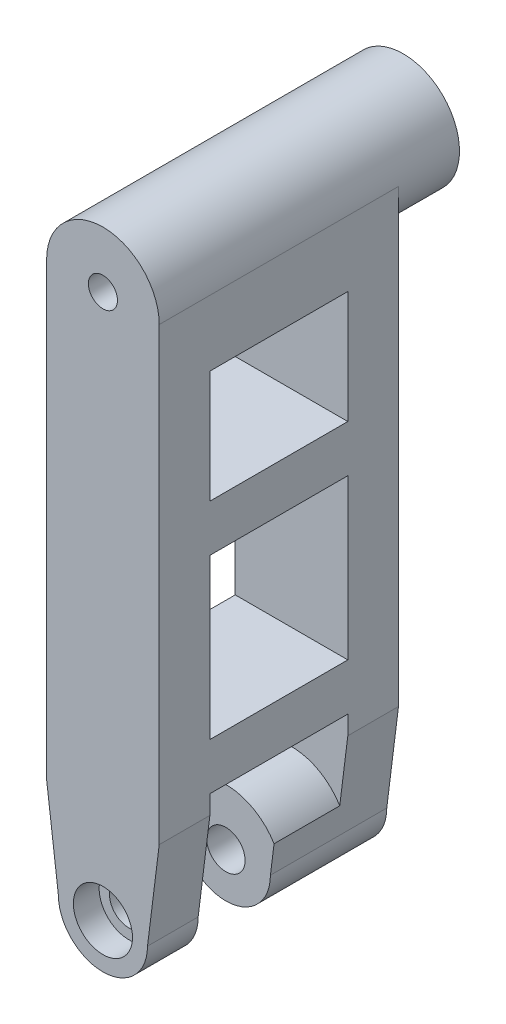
ISO-10303-21;
HEADER;
FILE_DESCRIPTION(('STEP AP214'),'2;1');
FILE_NAME('part.step','',(''),(''),'','','');
FILE_SCHEMA(('AUTOMOTIVE_DESIGN { 1 0 10303 214 1 1 1 1 }'));
ENDSEC;
DATA;
#1=APPLICATION_CONTEXT('core data for automotive mechanical design processes');
#2=APPLICATION_PROTOCOL_DEFINITION('international standard','automotive_design',2000,#1);
#3=PRODUCT_CONTEXT('',#1,'mechanical');
#4=PRODUCT('Part','Part','',(#3));
#5=PRODUCT_RELATED_PRODUCT_CATEGORY('part','',(#4));
#6=PRODUCT_DEFINITION_FORMATION('','',#4);
#7=PRODUCT_DEFINITION_CONTEXT('part definition',#1,'design');
#8=PRODUCT_DEFINITION('design','',#6,#7);
#9=PRODUCT_DEFINITION_SHAPE('','',#8);
#10=(LENGTH_UNIT() NAMED_UNIT(*) SI_UNIT(.MILLI.,.METRE.));
#11=(NAMED_UNIT(*) PLANE_ANGLE_UNIT() SI_UNIT($,.RADIAN.));
#12=(NAMED_UNIT(*) SI_UNIT($,.STERADIAN.) SOLID_ANGLE_UNIT());
#13=UNCERTAINTY_MEASURE_WITH_UNIT(LENGTH_MEASURE(1.E-05),#10,'distance_accuracy_value','');
#14=(GEOMETRIC_REPRESENTATION_CONTEXT(3) GLOBAL_UNCERTAINTY_ASSIGNED_CONTEXT((#13)) GLOBAL_UNIT_ASSIGNED_CONTEXT((#10,
#11,#12)) REPRESENTATION_CONTEXT('',''));
#15=CARTESIAN_POINT('',(0.,0.,0.));
#16=DIRECTION('',(0.,0.,1.));
#17=DIRECTION('',(1.,0.,0.));
#18=AXIS2_PLACEMENT_3D('',#15,#16,#17);
#19=CARTESIAN_POINT('',(6.,0.,-25.5));
#20=DIRECTION('',(0.,0.,1.));
#21=DIRECTION('',(1.,0.,0.));
#22=AXIS2_PLACEMENT_3D('',#19,#20,#21);
#23=CYLINDRICAL_SURFACE('',#22,2.05);
#24=CARTESIAN_POINT('',(6.,0.,-5.4));
#25=DIRECTION('',(0.,0.,1.));
#26=DIRECTION('',(1.,0.,0.));
#27=AXIS2_PLACEMENT_3D('',#24,#25,#26);
#28=CIRCLE('',#27,2.05);
#29=CARTESIAN_POINT('',(8.05,0.,-5.4));
#30=VERTEX_POINT('',#29);
#31=EDGE_CURVE('E413',#30,#30,#28,.F.);
#32=ORIENTED_EDGE('',*,*,#31,.T.);
#33=EDGE_LOOP('',(#32));
#34=FACE_BOUND('',#33,.T.);
#35=CARTESIAN_POINT('',(6.,0.,-2.75));
#36=DIRECTION('',(0.,0.,1.));
#37=DIRECTION('',(1.,0.,0.));
#38=AXIS2_PLACEMENT_3D('',#35,#36,#37);
#39=CIRCLE('',#38,2.05);
#40=CARTESIAN_POINT('',(8.05,0.,-2.75));
#41=VERTEX_POINT('',#40);
#42=EDGE_CURVE('E47',#41,#41,#39,.F.);
#43=ORIENTED_EDGE('',*,*,#42,.F.);
#44=EDGE_LOOP('',(#43));
#45=FACE_BOUND('',#44,.T.);
#46=ADVANCED_FACE('F43',(#34,#45),#23,.F.);
#47=CARTESIAN_POINT('',(6.,0.,-13.1));
#48=DIRECTION('',(0.,0.,1.));
#49=DIRECTION('',(1.,0.,0.));
#50=AXIS2_PLACEMENT_3D('',#47,#48,#49);
#51=CIRCLE('',#50,2.05);
#52=CARTESIAN_POINT('',(8.05,0.,-13.1));
#53=VERTEX_POINT('',#52);
#54=EDGE_CURVE('E335',#53,#53,#51,.F.);
#55=ORIENTED_EDGE('',*,*,#54,.F.);
#56=EDGE_LOOP('',(#55));
#57=FACE_BOUND('',#56,.T.);
#58=CARTESIAN_POINT('',(6.,0.,-22.75));
#59=DIRECTION('',(0.,0.,-1.));
#60=DIRECTION('',(-1.,0.,0.));
#61=AXIS2_PLACEMENT_3D('',#58,#59,#60);
#62=CIRCLE('',#61,2.05);
#63=CARTESIAN_POINT('',(3.95,0.,-22.75));
#64=VERTEX_POINT('',#63);
#65=EDGE_CURVE('E281',#64,#64,#62,.F.);
#66=ORIENTED_EDGE('',*,*,#65,.F.);
#67=EDGE_LOOP('',(#66));
#68=FACE_BOUND('',#67,.T.);
#69=ADVANCED_FACE('F460',(#57,#68),#23,.F.);
#70=CARTESIAN_POINT('',(6.,0.,-25.5));
#71=DIRECTION('',(0.,0.,1.));
#72=DIRECTION('',(1.,0.,0.));
#73=AXIS2_PLACEMENT_3D('',#70,#71,#72);
#74=CYLINDRICAL_SURFACE('',#73,6.);
#75=CARTESIAN_POINT('',(6.,0.,-20.1));
#76=DIRECTION('',(0.,0.,1.));
#77=DIRECTION('',(1.,0.,0.));
#78=AXIS2_PLACEMENT_3D('',#75,#76,#77);
#79=CIRCLE('',#78,6.);
#80=CARTESIAN_POINT('',(11.1374347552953,3.09947804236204,-20.1));
#81=VERTEX_POINT('',#80);
#82=CARTESIAN_POINT('',(0.862565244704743,3.09947804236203,-20.1));
#83=VERTEX_POINT('',#82);
#84=EDGE_CURVE('E334',#81,#83,#79,.T.);
#85=ORIENTED_EDGE('',*,*,#84,.T.);
#86=DIRECTION('',(0.,0.,1.));
#87=VECTOR('',#86,1.);
#88=CARTESIAN_POINT('',(0.862565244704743,3.09947804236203,-25.5));
#89=LINE('',#88,#87);
#90=CARTESIAN_POINT('',(0.862565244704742,3.09947804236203,-13.1));
#91=VERTEX_POINT('',#90);
#92=EDGE_CURVE('E325',#83,#91,#89,.T.);
#93=ORIENTED_EDGE('',*,*,#92,.T.);
#94=CARTESIAN_POINT('',(6.,0.,-13.1));
#95=DIRECTION('',(0.,0.,1.));
#96=DIRECTION('',(1.,0.,0.));
#97=AXIS2_PLACEMENT_3D('',#94,#95,#96);
#98=CIRCLE('',#97,6.);
#99=CARTESIAN_POINT('',(11.1374347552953,3.09947804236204,-13.1));
#100=VERTEX_POINT('',#99);
#101=EDGE_CURVE('E338',#100,#91,#98,.T.);
#102=ORIENTED_EDGE('',*,*,#101,.F.);
#103=DIRECTION('',(0.,0.,1.));
#104=VECTOR('',#103,1.);
#105=CARTESIAN_POINT('',(11.1374347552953,3.09947804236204,-25.5));
#106=LINE('',#105,#104);
#107=EDGE_CURVE('E308',#81,#100,#106,.T.);
#108=ORIENTED_EDGE('',*,*,#107,.F.);
#109=EDGE_LOOP('',(#85,#93,#102,#108));
#110=FACE_BOUND('',#109,.T.);
#111=ADVANCED_FACE('F45',(#110),#74,.T.);
#112=CARTESIAN_POINT('',(0.,0.,-25.5));
#113=DIRECTION('',(-1.,0.,0.));
#114=DIRECTION('',(0.,-1.,0.));
#115=AXIS2_PLACEMENT_3D('',#112,#113,#114);
#116=PLANE('',#115);
#117=DIRECTION('',(0.,1.,0.));
#118=VECTOR('',#117,1.);
#119=CARTESIAN_POINT('',(0.,0.,-5.4));
#120=LINE('',#119,#118);
#121=CARTESIAN_POINT('',(0.,17.,-5.4));
#122=VERTEX_POINT('',#121);
#123=CARTESIAN_POINT('',(0.,34.,-5.4));
#124=VERTEX_POINT('',#123);
#125=EDGE_CURVE('E432',#122,#124,#120,.T.);
#126=ORIENTED_EDGE('',*,*,#125,.F.);
#127=DIRECTION('',(0.,0.,1.));
#128=VECTOR('',#127,1.);
#129=CARTESIAN_POINT('',(0.,17.,-25.5));
#130=LINE('',#129,#128);
#131=CARTESIAN_POINT('',(0.,17.,-20.1));
#132=VERTEX_POINT('',#131);
#133=EDGE_CURVE('E425',#132,#122,#130,.T.);
#134=ORIENTED_EDGE('',*,*,#133,.F.);
#135=DIRECTION('',(0.,-1.,0.));
#136=VECTOR('',#135,1.);
#137=CARTESIAN_POINT('',(0.,0.,-20.1));
#138=LINE('',#137,#136);
#139=CARTESIAN_POINT('',(0.,34.,-20.1));
#140=VERTEX_POINT('',#139);
#141=EDGE_CURVE('E427',#140,#132,#138,.T.);
#142=ORIENTED_EDGE('',*,*,#141,.F.);
#143=DIRECTION('',(0.,0.,-1.));
#144=VECTOR('',#143,1.);
#145=CARTESIAN_POINT('',(0.,34.,-25.5));
#146=LINE('',#145,#144);
#147=EDGE_CURVE('E430',#124,#140,#146,.T.);
#148=ORIENTED_EDGE('',*,*,#147,.F.);
#149=EDGE_LOOP('',(#126,#134,#142,#148));
#150=FACE_BOUND('',#149,.T.);
#151=DIRECTION('',(0.,1.,0.));
#152=VECTOR('',#151,1.);
#153=CARTESIAN_POINT('',(0.,0.,-5.4));
#154=LINE('',#153,#152);
#155=CARTESIAN_POINT('',(0.,39.,-5.4));
#156=VERTEX_POINT('',#155);
#157=CARTESIAN_POINT('',(0.,51.,-5.4));
#158=VERTEX_POINT('',#157);
#159=EDGE_CURVE('E423',#156,#158,#154,.T.);
#160=ORIENTED_EDGE('',*,*,#159,.F.);
#161=DIRECTION('',(0.,0.,1.));
#162=VECTOR('',#161,1.);
#163=CARTESIAN_POINT('',(0.,39.,-25.5));
#164=LINE('',#163,#162);
#165=CARTESIAN_POINT('',(0.,39.,-20.1));
#166=VERTEX_POINT('',#165);
#167=EDGE_CURVE('E416',#166,#156,#164,.T.);
#168=ORIENTED_EDGE('',*,*,#167,.F.);
#169=DIRECTION('',(0.,-1.,0.));
#170=VECTOR('',#169,1.);
#171=CARTESIAN_POINT('',(0.,0.,-20.1));
#172=LINE('',#171,#170);
#173=CARTESIAN_POINT('',(0.,51.,-20.1));
#174=VERTEX_POINT('',#173);
#175=EDGE_CURVE('E418',#174,#166,#172,.T.);
#176=ORIENTED_EDGE('',*,*,#175,.F.);
#177=DIRECTION('',(0.,0.,-1.));
#178=VECTOR('',#177,1.);
#179=CARTESIAN_POINT('',(0.,51.,-25.5));
#180=LINE('',#179,#178);
#181=EDGE_CURVE('E421',#158,#174,#180,.T.);
#182=ORIENTED_EDGE('',*,*,#181,.F.);
#183=EDGE_LOOP('',(#160,#168,#176,#182));
#184=FACE_BOUND('',#183,.T.);
#185=DIRECTION('',(0.,-1.,0.));
#186=VECTOR('',#185,1.);
#187=CARTESIAN_POINT('',(0.,0.,-25.5));
#188=LINE('',#187,#186);
#189=CARTESIAN_POINT('',(0.,58.,-25.5));
#190=VERTEX_POINT('',#189);
#191=CARTESIAN_POINT('',(0.,9.99999999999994,-25.5));
#192=VERTEX_POINT('',#191);
#193=EDGE_CURVE('E442',#190,#192,#188,.T.);
#194=ORIENTED_EDGE('',*,*,#193,.T.);
#195=DIRECTION('',(0.,0.,-1.));
#196=VECTOR('',#195,1.);
#197=CARTESIAN_POINT('',(0.,9.99999999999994,0.));
#198=LINE('',#197,#196);
#199=CARTESIAN_POINT('',(0.,9.99999999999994,-20.1));
#200=VERTEX_POINT('',#199);
#201=EDGE_CURVE('E312',#200,#192,#198,.T.);
#202=ORIENTED_EDGE('',*,*,#201,.F.);
#203=DIRECTION('',(0.,-1.,0.));
#204=VECTOR('',#203,1.);
#205=CARTESIAN_POINT('',(0.,0.,-20.1));
#206=LINE('',#205,#204);
#207=CARTESIAN_POINT('',(0.,12.,-20.1));
#208=VERTEX_POINT('',#207);
#209=EDGE_CURVE('E370',#208,#200,#206,.T.);
#210=ORIENTED_EDGE('',*,*,#209,.F.);
#211=DIRECTION('',(0.,0.,-1.));
#212=VECTOR('',#211,1.);
#213=CARTESIAN_POINT('',(0.,12.,-25.5));
#214=LINE('',#213,#212);
#215=CARTESIAN_POINT('',(0.,12.,-5.4));
#216=VERTEX_POINT('',#215);
#217=EDGE_CURVE('E434',#216,#208,#214,.T.);
#218=ORIENTED_EDGE('',*,*,#217,.F.);
#219=DIRECTION('',(0.,1.,0.));
#220=VECTOR('',#219,1.);
#221=CARTESIAN_POINT('',(0.,0.,-5.4));
#222=LINE('',#221,#220);
#223=CARTESIAN_POINT('',(0.,9.99999999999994,-5.4));
#224=VERTEX_POINT('',#223);
#225=EDGE_CURVE('E414',#224,#216,#222,.T.);
#226=ORIENTED_EDGE('',*,*,#225,.F.);
#227=CARTESIAN_POINT('',(0.,9.99999999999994,0.));
#228=VERTEX_POINT('',#227);
#229=EDGE_CURVE('E310',#228,#224,#198,.T.);
#230=ORIENTED_EDGE('',*,*,#229,.F.);
#231=DIRECTION('',(0.,-1.,0.));
#232=VECTOR('',#231,1.);
#233=CARTESIAN_POINT('',(0.,0.,0.));
#234=LINE('',#233,#232);
#235=CARTESIAN_POINT('',(0.,58.,0.));
#236=VERTEX_POINT('',#235);
#237=EDGE_CURVE('E443',#236,#228,#234,.T.);
#238=ORIENTED_EDGE('',*,*,#237,.F.);
#239=DIRECTION('',(0.,0.,1.));
#240=VECTOR('',#239,1.);
#241=CARTESIAN_POINT('',(0.,58.,-25.5));
#242=LINE('',#241,#240);
#243=EDGE_CURVE('E354',#190,#236,#242,.T.);
#244=ORIENTED_EDGE('',*,*,#243,.F.);
#245=EDGE_LOOP('',(#194,#202,#210,#218,#226,#230,#238,#244));
#246=FACE_BOUND('',#245,.T.);
#247=ADVANCED_FACE('F469',(#150,#184,#246),#116,.T.);
#248=CARTESIAN_POINT('',(6.,0.,-25.5));
#249=DIRECTION('',(0.,0.,-1.));
#250=DIRECTION('',(-1.,0.,0.));
#251=AXIS2_PLACEMENT_3D('',#248,#249,#250);
#252=PLANE('',#251);
#253=DIRECTION('',(0.5,0.866025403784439,0.));
#254=VECTOR('',#253,1.);
#255=CARTESIAN_POINT('',(2.65136843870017,0.,-25.5));
#256=LINE('',#255,#254);
#257=CARTESIAN_POINT('',(2.65136843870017,0.,-25.5));
#258=VERTEX_POINT('',#257);
#259=CARTESIAN_POINT('',(4.32568421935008,2.9,-25.5));
#260=VERTEX_POINT('',#259);
#261=EDGE_CURVE('E60',#258,#260,#256,.T.);
#262=ORIENTED_EDGE('',*,*,#261,.F.);
#263=DIRECTION('',(-0.5,0.866025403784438,0.));
#264=VECTOR('',#263,1.);
#265=CARTESIAN_POINT('',(4.32568421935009,-2.9,-25.5));
#266=LINE('',#265,#264);
#267=CARTESIAN_POINT('',(4.32568421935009,-2.9,-25.5));
#268=VERTEX_POINT('',#267);
#269=EDGE_CURVE('E252',#268,#258,#266,.T.);
#270=ORIENTED_EDGE('',*,*,#269,.F.);
#271=DIRECTION('',(-1.,0.,0.));
#272=VECTOR('',#271,1.);
#273=CARTESIAN_POINT('',(7.67431578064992,-2.9,-25.5));
#274=LINE('',#273,#272);
#275=CARTESIAN_POINT('',(7.67431578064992,-2.9,-25.5));
#276=VERTEX_POINT('',#275);
#277=EDGE_CURVE('E255',#276,#268,#274,.T.);
#278=ORIENTED_EDGE('',*,*,#277,.F.);
#279=DIRECTION('',(-0.5,-0.866025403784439,0.));
#280=VECTOR('',#279,1.);
#281=CARTESIAN_POINT('',(9.34863156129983,0.,-25.5));
#282=LINE('',#281,#280);
#283=CARTESIAN_POINT('',(9.34863156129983,0.,-25.5));
#284=VERTEX_POINT('',#283);
#285=EDGE_CURVE('E274',#284,#276,#282,.T.);
#286=ORIENTED_EDGE('',*,*,#285,.F.);
#287=DIRECTION('',(0.5,-0.866025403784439,0.));
#288=VECTOR('',#287,1.);
#289=CARTESIAN_POINT('',(7.67431578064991,2.9,-25.5));
#290=LINE('',#289,#288);
#291=CARTESIAN_POINT('',(7.67431578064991,2.9,-25.5));
#292=VERTEX_POINT('',#291);
#293=EDGE_CURVE('E271',#292,#284,#290,.T.);
#294=ORIENTED_EDGE('',*,*,#293,.F.);
#295=DIRECTION('',(1.,0.,0.));
#296=VECTOR('',#295,1.);
#297=CARTESIAN_POINT('',(4.32568421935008,2.9,-25.5));
#298=LINE('',#297,#296);
#299=EDGE_CURVE('E269',#260,#292,#298,.T.);
#300=ORIENTED_EDGE('',*,*,#299,.F.);
#301=EDGE_LOOP('',(#262,#270,#278,#286,#294,#300));
#302=FACE_BOUND('',#301,.T.);
#303=CARTESIAN_POINT('',(6.,0.,-25.5));
#304=DIRECTION('',(0.,0.,-1.));
#305=DIRECTION('',(-1.,0.,0.));
#306=AXIS2_PLACEMENT_3D('',#303,#304,#305);
#307=CIRCLE('',#306,4.75);
#308=CARTESIAN_POINT('',(10.75,0.,-25.5));
#309=VERTEX_POINT('',#308);
#310=CARTESIAN_POINT('',(1.25,0.,-25.5));
#311=VERTEX_POINT('',#310);
#312=EDGE_CURVE('E298',#309,#311,#307,.T.);
#313=ORIENTED_EDGE('',*,*,#312,.T.);
#314=DIRECTION('',(-0.124034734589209,0.992277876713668,0.));
#315=VECTOR('',#314,1.);
#316=CARTESIAN_POINT('',(1.23076923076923,0.153846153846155,-25.5));
#317=LINE('',#316,#315);
#318=EDGE_CURVE('E292',#311,#192,#317,.T.);
#319=ORIENTED_EDGE('',*,*,#318,.T.);
#320=ORIENTED_EDGE('',*,*,#193,.F.);
#321=CARTESIAN_POINT('',(5.99999999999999,58.,-25.5));
#322=DIRECTION('',(0.,0.,-1.));
#323=DIRECTION('',(-1.,0.,0.));
#324=AXIS2_PLACEMENT_3D('',#321,#322,#323);
#325=CIRCLE('',#324,6.);
#326=CARTESIAN_POINT('',(12.,58.,-25.5));
#327=VERTEX_POINT('',#326);
#328=EDGE_CURVE('E350',#327,#190,#325,.T.);
#329=ORIENTED_EDGE('',*,*,#328,.F.);
#330=DIRECTION('',(0.,1.,0.));
#331=VECTOR('',#330,1.);
#332=CARTESIAN_POINT('',(12.,0.,-25.5));
#333=LINE('',#332,#331);
#334=CARTESIAN_POINT('',(12.,10.,-25.5));
#335=VERTEX_POINT('',#334);
#336=EDGE_CURVE('E440',#335,#327,#333,.T.);
#337=ORIENTED_EDGE('',*,*,#336,.F.);
#338=DIRECTION('',(0.124034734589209,0.992277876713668,0.));
#339=VECTOR('',#338,1.);
#340=CARTESIAN_POINT('',(10.5846153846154,-1.32307692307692,-25.5));
#341=LINE('',#340,#339);
#342=EDGE_CURVE('E301',#309,#335,#341,.T.);
#343=ORIENTED_EDGE('',*,*,#342,.F.);
#344=EDGE_LOOP('',(#313,#319,#320,#329,#337,#343));
#345=FACE_BOUND('',#344,.T.);
#346=ADVANCED_FACE('F484',(#302,#345),#252,.T.);
#347=CARTESIAN_POINT('',(6.,0.,0.));
#348=DIRECTION('',(0.,0.,-1.));
#349=DIRECTION('',(-1.,0.,0.));
#350=AXIS2_PLACEMENT_3D('',#347,#348,#349);
#351=PLANE('',#350);
#352=CARTESIAN_POINT('',(6.,0.,0.));
#353=DIRECTION('',(0.,0.,1.));
#354=DIRECTION('',(1.,0.,0.));
#355=AXIS2_PLACEMENT_3D('',#352,#353,#354);
#356=CIRCLE('',#355,3.15);
#357=CARTESIAN_POINT('',(9.15,0.,0.));
#358=VERTEX_POINT('',#357);
#359=EDGE_CURVE('E258',#358,#358,#356,.T.);
#360=ORIENTED_EDGE('',*,*,#359,.F.);
#361=EDGE_LOOP('',(#360));
#362=FACE_BOUND('',#361,.T.);
#363=CARTESIAN_POINT('',(5.99999999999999,58.,0.));
#364=DIRECTION('',(0.,0.,1.));
#365=DIRECTION('',(1.,0.,0.));
#366=AXIS2_PLACEMENT_3D('',#363,#364,#365);
#367=CIRCLE('',#366,1.55);
#368=CARTESIAN_POINT('',(7.54999999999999,58.,0.));
#369=VERTEX_POINT('',#368);
#370=EDGE_CURVE('E436',#369,#369,#367,.T.);
#371=ORIENTED_EDGE('',*,*,#370,.F.);
#372=EDGE_LOOP('',(#371));
#373=FACE_BOUND('',#372,.T.);
#374=DIRECTION('',(-0.124034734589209,0.992277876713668,0.));
#375=VECTOR('',#374,1.);
#376=CARTESIAN_POINT('',(1.23076923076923,0.153846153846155,0.));
#377=LINE('',#376,#375);
#378=CARTESIAN_POINT('',(1.25,0.,0.));
#379=VERTEX_POINT('',#378);
#380=EDGE_CURVE('E295',#379,#228,#377,.T.);
#381=ORIENTED_EDGE('',*,*,#380,.F.);
#382=CARTESIAN_POINT('',(6.,0.,0.));
#383=DIRECTION('',(0.,0.,-1.));
#384=DIRECTION('',(-1.,0.,0.));
#385=AXIS2_PLACEMENT_3D('',#382,#383,#384);
#386=CIRCLE('',#385,4.75);
#387=CARTESIAN_POINT('',(10.75,0.,0.));
#388=VERTEX_POINT('',#387);
#389=EDGE_CURVE('E289',#388,#379,#386,.T.);
#390=ORIENTED_EDGE('',*,*,#389,.F.);
#391=DIRECTION('',(0.124034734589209,0.992277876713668,0.));
#392=VECTOR('',#391,1.);
#393=CARTESIAN_POINT('',(10.5846153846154,-1.32307692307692,0.));
#394=LINE('',#393,#392);
#395=CARTESIAN_POINT('',(12.,10.,0.));
#396=VERTEX_POINT('',#395);
#397=EDGE_CURVE('E291',#388,#396,#394,.T.);
#398=ORIENTED_EDGE('',*,*,#397,.T.);
#399=DIRECTION('',(0.,1.,0.));
#400=VECTOR('',#399,1.);
#401=CARTESIAN_POINT('',(12.,0.,0.));
#402=LINE('',#401,#400);
#403=CARTESIAN_POINT('',(12.,58.,0.));
#404=VERTEX_POINT('',#403);
#405=EDGE_CURVE('E439',#396,#404,#402,.T.);
#406=ORIENTED_EDGE('',*,*,#405,.T.);
#407=CARTESIAN_POINT('',(5.99999999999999,58.,0.));
#408=DIRECTION('',(0.,0.,-1.));
#409=DIRECTION('',(-1.,0.,0.));
#410=AXIS2_PLACEMENT_3D('',#407,#408,#409);
#411=CIRCLE('',#410,6.);
#412=EDGE_CURVE('E349',#404,#236,#411,.F.);
#413=ORIENTED_EDGE('',*,*,#412,.T.);
#414=ORIENTED_EDGE('',*,*,#237,.T.);
#415=EDGE_LOOP('',(#381,#390,#398,#406,#413,#414));
#416=FACE_BOUND('',#415,.T.);
#417=ADVANCED_FACE('F486',(#362,#373,#416),#351,.F.);
#418=CARTESIAN_POINT('',(-8.,-6.,-5.4));
#419=DIRECTION('',(0.,0.,1.));
#420=DIRECTION('',(1.,0.,0.));
#421=AXIS2_PLACEMENT_3D('',#418,#419,#420);
#422=PLANE('',#421);
#423=ORIENTED_EDGE('',*,*,#31,.F.);
#424=EDGE_LOOP('',(#423));
#425=FACE_BOUND('',#424,.T.);
#426=DIRECTION('',(0.124034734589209,-0.992277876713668,0.));
#427=VECTOR('',#426,1.);
#428=CARTESIAN_POINT('',(1.84615384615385,-4.76923076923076,-5.4));
#429=LINE('',#428,#427);
#430=CARTESIAN_POINT('',(1.25,0.,-5.4));
#431=VERTEX_POINT('',#430);
#432=EDGE_CURVE('E330',#224,#431,#429,.T.);
#433=ORIENTED_EDGE('',*,*,#432,.F.);
#434=ORIENTED_EDGE('',*,*,#225,.T.);
#435=DIRECTION('',(1.,0.,0.));
#436=VECTOR('',#435,1.);
#437=CARTESIAN_POINT('',(-8.,12.,-5.4));
#438=LINE('',#437,#436);
#439=CARTESIAN_POINT('',(12.,12.,-5.4));
#440=VERTEX_POINT('',#439);
#441=EDGE_CURVE('E368',#216,#440,#438,.T.);
#442=ORIENTED_EDGE('',*,*,#441,.T.);
#443=DIRECTION('',(0.,-1.,0.));
#444=VECTOR('',#443,1.);
#445=CARTESIAN_POINT('',(12.,-6.,-5.4));
#446=LINE('',#445,#444);
#447=CARTESIAN_POINT('',(12.,10.,-5.4));
#448=VERTEX_POINT('',#447);
#449=EDGE_CURVE('E358',#440,#448,#446,.T.);
#450=ORIENTED_EDGE('',*,*,#449,.T.);
#451=DIRECTION('',(-0.124034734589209,-0.992277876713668,0.));
#452=VECTOR('',#451,1.);
#453=CARTESIAN_POINT('',(9.72307692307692,-8.21538461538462,-5.4));
#454=LINE('',#453,#452);
#455=CARTESIAN_POINT('',(10.75,0.,-5.4));
#456=VERTEX_POINT('',#455);
#457=EDGE_CURVE('E322',#448,#456,#454,.T.);
#458=ORIENTED_EDGE('',*,*,#457,.T.);
#459=CARTESIAN_POINT('',(6.,0.,-5.4));
#460=DIRECTION('',(0.,0.,1.));
#461=DIRECTION('',(1.,0.,0.));
#462=AXIS2_PLACEMENT_3D('',#459,#460,#461);
#463=CIRCLE('',#462,4.75);
#464=EDGE_CURVE('E332',#431,#456,#463,.T.);
#465=ORIENTED_EDGE('',*,*,#464,.F.);
#466=EDGE_LOOP('',(#433,#434,#442,#450,#458,#465));
#467=FACE_BOUND('',#466,.T.);
#468=ADVANCED_FACE('F490',(#425,#467),#422,.F.);
#469=CARTESIAN_POINT('',(-8.,-6.,-20.1));
#470=DIRECTION('',(0.,0.,-1.));
#471=DIRECTION('',(-1.,0.,0.));
#472=AXIS2_PLACEMENT_3D('',#469,#470,#471);
#473=PLANE('',#472);
#474=DIRECTION('',(-0.124034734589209,0.992277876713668,0.));
#475=VECTOR('',#474,1.);
#476=CARTESIAN_POINT('',(1.84615384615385,-4.76923076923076,-20.1));
#477=LINE('',#476,#475);
#478=EDGE_CURVE('E328',#83,#200,#477,.T.);
#479=ORIENTED_EDGE('',*,*,#478,.F.);
#480=ORIENTED_EDGE('',*,*,#84,.F.);
#481=DIRECTION('',(0.124034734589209,0.992277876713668,0.));
#482=VECTOR('',#481,1.);
#483=CARTESIAN_POINT('',(9.72307692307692,-8.21538461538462,-20.1));
#484=LINE('',#483,#482);
#485=CARTESIAN_POINT('',(12.,10.,-20.1));
#486=VERTEX_POINT('',#485);
#487=EDGE_CURVE('E319',#81,#486,#484,.T.);
#488=ORIENTED_EDGE('',*,*,#487,.T.);
#489=DIRECTION('',(0.,1.,0.));
#490=VECTOR('',#489,1.);
#491=CARTESIAN_POINT('',(12.,-6.,-20.1));
#492=LINE('',#491,#490);
#493=CARTESIAN_POINT('',(12.,12.,-20.1));
#494=VERTEX_POINT('',#493);
#495=EDGE_CURVE('E361',#486,#494,#492,.T.);
#496=ORIENTED_EDGE('',*,*,#495,.T.);
#497=DIRECTION('',(1.,0.,0.));
#498=VECTOR('',#497,1.);
#499=CARTESIAN_POINT('',(-8.,12.,-20.1));
#500=LINE('',#499,#498);
#501=EDGE_CURVE('E367',#208,#494,#500,.T.);
#502=ORIENTED_EDGE('',*,*,#501,.F.);
#503=ORIENTED_EDGE('',*,*,#209,.T.);
#504=EDGE_LOOP('',(#479,#480,#488,#496,#502,#503));
#505=FACE_BOUND('',#504,.T.);
#506=ADVANCED_FACE('F560',(#505),#473,.F.);
#507=CARTESIAN_POINT('',(0.,0.,-13.1));
#508=DIRECTION('',(0.,0.,1.));
#509=DIRECTION('',(1.,0.,0.));
#510=AXIS2_PLACEMENT_3D('',#507,#508,#509);
#511=PLANE('',#510);
#512=ORIENTED_EDGE('',*,*,#54,.T.);
#513=EDGE_LOOP('',(#512));
#514=FACE_BOUND('',#513,.T.);
#515=ORIENTED_EDGE('',*,*,#101,.T.);
#516=DIRECTION('',(0.124034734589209,-0.992277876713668,0.));
#517=VECTOR('',#516,1.);
#518=CARTESIAN_POINT('',(1.23076923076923,0.153846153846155,-13.1));
#519=LINE('',#518,#517);
#520=CARTESIAN_POINT('',(1.25,0.,-13.1));
#521=VERTEX_POINT('',#520);
#522=EDGE_CURVE('E11',#91,#521,#519,.T.);
#523=ORIENTED_EDGE('',*,*,#522,.T.);
#524=CARTESIAN_POINT('',(6.,0.,-13.1));
#525=DIRECTION('',(0.,0.,1.));
#526=DIRECTION('',(1.,0.,0.));
#527=AXIS2_PLACEMENT_3D('',#524,#525,#526);
#528=CIRCLE('',#527,4.75);
#529=CARTESIAN_POINT('',(10.75,0.,-13.1));
#530=VERTEX_POINT('',#529);
#531=EDGE_CURVE('E52',#521,#530,#528,.T.);
#532=ORIENTED_EDGE('',*,*,#531,.T.);
#533=DIRECTION('',(-0.124034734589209,-0.992277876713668,0.));
#534=VECTOR('',#533,1.);
#535=CARTESIAN_POINT('',(10.5846153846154,-1.32307692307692,-13.1));
#536=LINE('',#535,#534);
#537=EDGE_CURVE('E353',#100,#530,#536,.T.);
#538=ORIENTED_EDGE('',*,*,#537,.F.);
#539=EDGE_LOOP('',(#515,#523,#532,#538));
#540=FACE_BOUND('',#539,.T.);
#541=ADVANCED_FACE('F497',(#514,#540),#511,.T.);
#542=CARTESIAN_POINT('',(5.99999999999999,58.,-25.5));
#543=DIRECTION('',(0.,0.,1.));
#544=DIRECTION('',(1.,0.,0.));
#545=AXIS2_PLACEMENT_3D('',#542,#543,#544);
#546=CYLINDRICAL_SURFACE('',#545,6.);
#547=ORIENTED_EDGE('',*,*,#243,.T.);
#548=ORIENTED_EDGE('',*,*,#412,.F.);
#549=DIRECTION('',(0.,0.,1.));
#550=VECTOR('',#549,1.);
#551=CARTESIAN_POINT('',(12.,58.,-25.5));
#552=LINE('',#551,#550);
#553=EDGE_CURVE('E446',#327,#404,#552,.T.);
#554=ORIENTED_EDGE('',*,*,#553,.F.);
#555=ORIENTED_EDGE('',*,*,#328,.T.);
#556=EDGE_LOOP('',(#547,#548,#554,#555));
#557=FACE_BOUND('',#556,.T.);
#558=CARTESIAN_POINT('',(5.99999999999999,58.,-32.));
#559=DIRECTION('',(0.,0.,-1.));
#560=DIRECTION('',(-1.,0.,0.));
#561=AXIS2_PLACEMENT_3D('',#558,#559,#560);
#562=CIRCLE('',#561,6.);
#563=CARTESIAN_POINT('',(0.,58.,-32.));
#564=VERTEX_POINT('',#563);
#565=EDGE_CURVE('E346',#564,#564,#562,.T.);
#566=ORIENTED_EDGE('',*,*,#565,.F.);
#567=EDGE_LOOP('',(#566));
#568=FACE_BOUND('',#567,.T.);
#569=ADVANCED_FACE('F495',(#557,#568),#546,.T.);
#570=CARTESIAN_POINT('',(12.,0.,-25.5));
#571=DIRECTION('',(1.,0.,0.));
#572=DIRECTION('',(0.,1.,0.));
#573=AXIS2_PLACEMENT_3D('',#570,#571,#572);
#574=PLANE('',#573);
#575=DIRECTION('',(0.,0.,-1.));
#576=VECTOR('',#575,1.);
#577=CARTESIAN_POINT('',(12.,10.,0.));
#578=LINE('',#577,#576);
#579=EDGE_CURVE('E316',#486,#335,#578,.T.);
#580=ORIENTED_EDGE('',*,*,#579,.T.);
#581=ORIENTED_EDGE('',*,*,#336,.T.);
#582=ORIENTED_EDGE('',*,*,#553,.T.);
#583=ORIENTED_EDGE('',*,*,#405,.F.);
#584=EDGE_CURVE('E313',#396,#448,#578,.T.);
#585=ORIENTED_EDGE('',*,*,#584,.T.);
#586=ORIENTED_EDGE('',*,*,#449,.F.);
#587=DIRECTION('',(0.,0.,1.));
#588=VECTOR('',#587,1.);
#589=CARTESIAN_POINT('',(12.,12.,-5.4));
#590=LINE('',#589,#588);
#591=EDGE_CURVE('E364',#494,#440,#590,.T.);
#592=ORIENTED_EDGE('',*,*,#591,.F.);
#593=ORIENTED_EDGE('',*,*,#495,.F.);
#594=EDGE_LOOP('',(#580,#581,#582,#583,#585,#586,#592,#593));
#595=FACE_BOUND('',#594,.T.);
#596=DIRECTION('',(0.,-1.,0.));
#597=VECTOR('',#596,1.);
#598=CARTESIAN_POINT('',(12.,17.,-5.4));
#599=LINE('',#598,#597);
#600=CARTESIAN_POINT('',(12.,34.,-5.4));
#601=VERTEX_POINT('',#600);
#602=CARTESIAN_POINT('',(12.,17.,-5.4));
#603=VERTEX_POINT('',#602);
#604=EDGE_CURVE('E373',#601,#603,#599,.T.);
#605=ORIENTED_EDGE('',*,*,#604,.F.);
#606=DIRECTION('',(0.,0.,1.));
#607=VECTOR('',#606,1.);
#608=CARTESIAN_POINT('',(12.,34.,-5.4));
#609=LINE('',#608,#607);
#610=CARTESIAN_POINT('',(12.,34.,-20.1));
#611=VERTEX_POINT('',#610);
#612=EDGE_CURVE('E382',#611,#601,#609,.T.);
#613=ORIENTED_EDGE('',*,*,#612,.F.);
#614=DIRECTION('',(0.,1.,0.));
#615=VECTOR('',#614,1.);
#616=CARTESIAN_POINT('',(12.,17.,-20.1));
#617=LINE('',#616,#615);
#618=CARTESIAN_POINT('',(12.,17.,-20.1));
#619=VERTEX_POINT('',#618);
#620=EDGE_CURVE('E379',#619,#611,#617,.T.);
#621=ORIENTED_EDGE('',*,*,#620,.F.);
#622=DIRECTION('',(0.,0.,-1.));
#623=VECTOR('',#622,1.);
#624=CARTESIAN_POINT('',(12.,17.,-5.4));
#625=LINE('',#624,#623);
#626=EDGE_CURVE('E375',#603,#619,#625,.T.);
#627=ORIENTED_EDGE('',*,*,#626,.F.);
#628=EDGE_LOOP('',(#605,#613,#621,#627));
#629=FACE_BOUND('',#628,.T.);
#630=DIRECTION('',(0.,-1.,0.));
#631=VECTOR('',#630,1.);
#632=CARTESIAN_POINT('',(12.,39.,-5.4));
#633=LINE('',#632,#631);
#634=CARTESIAN_POINT('',(12.,51.,-5.4));
#635=VERTEX_POINT('',#634);
#636=CARTESIAN_POINT('',(12.,39.,-5.4));
#637=VERTEX_POINT('',#636);
#638=EDGE_CURVE('E357',#635,#637,#633,.T.);
#639=ORIENTED_EDGE('',*,*,#638,.F.);
#640=DIRECTION('',(0.,0.,1.));
#641=VECTOR('',#640,1.);
#642=CARTESIAN_POINT('',(12.,51.,-5.4));
#643=LINE('',#642,#641);
#644=CARTESIAN_POINT('',(12.,51.,-20.1));
#645=VERTEX_POINT('',#644);
#646=EDGE_CURVE('E400',#645,#635,#643,.T.);
#647=ORIENTED_EDGE('',*,*,#646,.F.);
#648=DIRECTION('',(0.,1.,0.));
#649=VECTOR('',#648,1.);
#650=CARTESIAN_POINT('',(12.,39.,-20.1));
#651=LINE('',#650,#649);
#652=CARTESIAN_POINT('',(12.,39.,-20.1));
#653=VERTEX_POINT('',#652);
#654=EDGE_CURVE('E397',#653,#645,#651,.T.);
#655=ORIENTED_EDGE('',*,*,#654,.F.);
#656=DIRECTION('',(0.,0.,-1.));
#657=VECTOR('',#656,1.);
#658=CARTESIAN_POINT('',(12.,39.,-5.4));
#659=LINE('',#658,#657);
#660=EDGE_CURVE('E394',#637,#653,#659,.T.);
#661=ORIENTED_EDGE('',*,*,#660,.F.);
#662=EDGE_LOOP('',(#639,#647,#655,#661));
#663=FACE_BOUND('',#662,.T.);
#664=ADVANCED_FACE('F482',(#595,#629,#663),#574,.T.);
#665=CARTESIAN_POINT('',(5.99999999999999,58.,-25.5));
#666=DIRECTION('',(0.,0.,1.));
#667=DIRECTION('',(1.,0.,0.));
#668=AXIS2_PLACEMENT_3D('',#665,#666,#667);
#669=CYLINDRICAL_SURFACE('',#668,1.55);
#670=ORIENTED_EDGE('',*,*,#370,.T.);
#671=EDGE_LOOP('',(#670));
#672=FACE_BOUND('',#671,.T.);
#673=CARTESIAN_POINT('',(5.99999999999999,58.,-32.));
#674=DIRECTION('',(0.,0.,-1.));
#675=DIRECTION('',(-1.,0.,0.));
#676=AXIS2_PLACEMENT_3D('',#673,#674,#675);
#677=CIRCLE('',#676,1.55);
#678=CARTESIAN_POINT('',(4.44999999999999,58.,-32.));
#679=VERTEX_POINT('',#678);
#680=EDGE_CURVE('E341',#679,#679,#677,.F.);
#681=ORIENTED_EDGE('',*,*,#680,.F.);
#682=EDGE_LOOP('',(#681));
#683=FACE_BOUND('',#682,.T.);
#684=ADVANCED_FACE('F478',(#672,#683),#669,.F.);
#685=CARTESIAN_POINT('',(-8.,12.,-5.4));
#686=DIRECTION('',(0.,1.,0.));
#687=DIRECTION('',(-1.,0.,0.));
#688=AXIS2_PLACEMENT_3D('',#685,#686,#687);
#689=PLANE('',#688);
#690=ORIENTED_EDGE('',*,*,#217,.T.);
#691=ORIENTED_EDGE('',*,*,#501,.T.);
#692=ORIENTED_EDGE('',*,*,#591,.T.);
#693=ORIENTED_EDGE('',*,*,#441,.F.);
#694=EDGE_LOOP('',(#690,#691,#692,#693));
#695=FACE_BOUND('',#694,.T.);
#696=ADVANCED_FACE('F481',(#695),#689,.F.);
#697=CARTESIAN_POINT('',(-8.00000000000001,39.,-5.4));
#698=DIRECTION('',(0.,0.,1.));
#699=DIRECTION('',(1.,0.,0.));
#700=AXIS2_PLACEMENT_3D('',#697,#698,#699);
#701=PLANE('',#700);
#702=ORIENTED_EDGE('',*,*,#159,.T.);
#703=DIRECTION('',(1.,0.,0.));
#704=VECTOR('',#703,1.);
#705=CARTESIAN_POINT('',(-8.00000000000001,51.,-5.4));
#706=LINE('',#705,#704);
#707=EDGE_CURVE('E376',#158,#635,#706,.T.);
#708=ORIENTED_EDGE('',*,*,#707,.T.);
#709=ORIENTED_EDGE('',*,*,#638,.T.);
#710=DIRECTION('',(1.,0.,0.));
#711=VECTOR('',#710,1.);
#712=CARTESIAN_POINT('',(-8.00000000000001,39.,-5.4));
#713=LINE('',#712,#711);
#714=EDGE_CURVE('E403',#156,#637,#713,.T.);
#715=ORIENTED_EDGE('',*,*,#714,.F.);
#716=EDGE_LOOP('',(#702,#708,#709,#715));
#717=FACE_BOUND('',#716,.T.);
#718=ADVANCED_FACE('F476',(#717),#701,.F.);
#719=CARTESIAN_POINT('',(-8.00000000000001,51.,-5.4));
#720=DIRECTION('',(0.,1.,0.));
#721=DIRECTION('',(-1.,0.,0.));
#722=AXIS2_PLACEMENT_3D('',#719,#720,#721);
#723=PLANE('',#722);
#724=ORIENTED_EDGE('',*,*,#181,.T.);
#725=DIRECTION('',(1.,0.,0.));
#726=VECTOR('',#725,1.);
#727=CARTESIAN_POINT('',(-8.00000000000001,51.,-20.1));
#728=LINE('',#727,#726);
#729=EDGE_CURVE('E405',#174,#645,#728,.T.);
#730=ORIENTED_EDGE('',*,*,#729,.T.);
#731=ORIENTED_EDGE('',*,*,#646,.T.);
#732=ORIENTED_EDGE('',*,*,#707,.F.);
#733=EDGE_LOOP('',(#724,#730,#731,#732));
#734=FACE_BOUND('',#733,.T.);
#735=ADVANCED_FACE('F529',(#734),#723,.F.);
#736=CARTESIAN_POINT('',(-8.00000000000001,39.,-20.1));
#737=DIRECTION('',(0.,0.,-1.));
#738=DIRECTION('',(-1.,0.,0.));
#739=AXIS2_PLACEMENT_3D('',#736,#737,#738);
#740=PLANE('',#739);
#741=ORIENTED_EDGE('',*,*,#175,.T.);
#742=DIRECTION('',(1.,0.,0.));
#743=VECTOR('',#742,1.);
#744=CARTESIAN_POINT('',(-8.00000000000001,39.,-20.1));
#745=LINE('',#744,#743);
#746=EDGE_CURVE('E407',#166,#653,#745,.T.);
#747=ORIENTED_EDGE('',*,*,#746,.T.);
#748=ORIENTED_EDGE('',*,*,#654,.T.);
#749=ORIENTED_EDGE('',*,*,#729,.F.);
#750=EDGE_LOOP('',(#741,#747,#748,#749));
#751=FACE_BOUND('',#750,.T.);
#752=ADVANCED_FACE('F532',(#751),#740,.F.);
#753=CARTESIAN_POINT('',(-8.00000000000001,39.,-5.4));
#754=DIRECTION('',(0.,-1.,0.));
#755=DIRECTION('',(1.,0.,0.));
#756=AXIS2_PLACEMENT_3D('',#753,#754,#755);
#757=PLANE('',#756);
#758=ORIENTED_EDGE('',*,*,#167,.T.);
#759=ORIENTED_EDGE('',*,*,#714,.T.);
#760=ORIENTED_EDGE('',*,*,#660,.T.);
#761=ORIENTED_EDGE('',*,*,#746,.F.);
#762=EDGE_LOOP('',(#758,#759,#760,#761));
#763=FACE_BOUND('',#762,.T.);
#764=ADVANCED_FACE('F522',(#763),#757,.F.);
#765=CARTESIAN_POINT('',(-8.,17.,-5.4));
#766=DIRECTION('',(0.,0.,1.));
#767=DIRECTION('',(1.,0.,0.));
#768=AXIS2_PLACEMENT_3D('',#765,#766,#767);
#769=PLANE('',#768);
#770=ORIENTED_EDGE('',*,*,#125,.T.);
#771=DIRECTION('',(1.,0.,0.));
#772=VECTOR('',#771,1.);
#773=CARTESIAN_POINT('',(-8.00000000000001,34.,-5.4));
#774=LINE('',#773,#772);
#775=EDGE_CURVE('E362',#124,#601,#774,.T.);
#776=ORIENTED_EDGE('',*,*,#775,.T.);
#777=ORIENTED_EDGE('',*,*,#604,.T.);
#778=DIRECTION('',(1.,0.,0.));
#779=VECTOR('',#778,1.);
#780=CARTESIAN_POINT('',(-8.,17.,-5.4));
#781=LINE('',#780,#779);
#782=EDGE_CURVE('E385',#122,#603,#781,.T.);
#783=ORIENTED_EDGE('',*,*,#782,.F.);
#784=EDGE_LOOP('',(#770,#776,#777,#783));
#785=FACE_BOUND('',#784,.T.);
#786=ADVANCED_FACE('F539',(#785),#769,.F.);
#787=CARTESIAN_POINT('',(-8.00000000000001,34.,-5.4));
#788=DIRECTION('',(0.,1.,0.));
#789=DIRECTION('',(-1.,0.,0.));
#790=AXIS2_PLACEMENT_3D('',#787,#788,#789);
#791=PLANE('',#790);
#792=ORIENTED_EDGE('',*,*,#147,.T.);
#793=DIRECTION('',(1.,0.,0.));
#794=VECTOR('',#793,1.);
#795=CARTESIAN_POINT('',(-8.00000000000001,34.,-20.1));
#796=LINE('',#795,#794);
#797=EDGE_CURVE('E387',#140,#611,#796,.T.);
#798=ORIENTED_EDGE('',*,*,#797,.T.);
#799=ORIENTED_EDGE('',*,*,#612,.T.);
#800=ORIENTED_EDGE('',*,*,#775,.F.);
#801=EDGE_LOOP('',(#792,#798,#799,#800));
#802=FACE_BOUND('',#801,.T.);
#803=ADVANCED_FACE('F544',(#802),#791,.F.);
#804=CARTESIAN_POINT('',(-8.,17.,-20.1));
#805=DIRECTION('',(0.,0.,-1.));
#806=DIRECTION('',(0.,1.,0.));
#807=AXIS2_PLACEMENT_3D('',#804,#805,#806);
#808=PLANE('',#807);
#809=ORIENTED_EDGE('',*,*,#141,.T.);
#810=DIRECTION('',(1.,0.,0.));
#811=VECTOR('',#810,1.);
#812=CARTESIAN_POINT('',(-8.,17.,-20.1));
#813=LINE('',#812,#811);
#814=EDGE_CURVE('E389',#132,#619,#813,.T.);
#815=ORIENTED_EDGE('',*,*,#814,.T.);
#816=ORIENTED_EDGE('',*,*,#620,.T.);
#817=ORIENTED_EDGE('',*,*,#797,.F.);
#818=EDGE_LOOP('',(#809,#815,#816,#817));
#819=FACE_BOUND('',#818,.T.);
#820=ADVANCED_FACE('F550',(#819),#808,.F.);
#821=CARTESIAN_POINT('',(-8.,17.,-5.4));
#822=DIRECTION('',(0.,-1.,0.));
#823=DIRECTION('',(1.,0.,0.));
#824=AXIS2_PLACEMENT_3D('',#821,#822,#823);
#825=PLANE('',#824);
#826=ORIENTED_EDGE('',*,*,#133,.T.);
#827=ORIENTED_EDGE('',*,*,#782,.T.);
#828=ORIENTED_EDGE('',*,*,#626,.T.);
#829=ORIENTED_EDGE('',*,*,#814,.F.);
#830=EDGE_LOOP('',(#826,#827,#828,#829));
#831=FACE_BOUND('',#830,.T.);
#832=ADVANCED_FACE('F546',(#831),#825,.F.);
#833=CARTESIAN_POINT('',(0.,0.,-32.));
#834=DIRECTION('',(0.,0.,-1.));
#835=DIRECTION('',(-1.,0.,0.));
#836=AXIS2_PLACEMENT_3D('',#833,#834,#835);
#837=PLANE('',#836);
#838=ORIENTED_EDGE('',*,*,#680,.T.);
#839=EDGE_LOOP('',(#838));
#840=FACE_BOUND('',#839,.T.);
#841=ORIENTED_EDGE('',*,*,#565,.T.);
#842=EDGE_LOOP('',(#841));
#843=FACE_BOUND('',#842,.T.);
#844=ADVANCED_FACE('F549',(#840,#843),#837,.T.);
#845=CARTESIAN_POINT('',(10.5846153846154,-1.32307692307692,0.));
#846=DIRECTION('',(-0.992277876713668,0.124034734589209,0.));
#847=DIRECTION('',(-0.124034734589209,-0.992277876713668,0.));
#848=AXIS2_PLACEMENT_3D('',#845,#846,#847);
#849=PLANE('',#848);
#850=ORIENTED_EDGE('',*,*,#107,.T.);
#851=ORIENTED_EDGE('',*,*,#537,.T.);
#852=DIRECTION('',(0.,0.,-1.));
#853=VECTOR('',#852,1.);
#854=CARTESIAN_POINT('',(10.75,0.,0.));
#855=LINE('',#854,#853);
#856=EDGE_CURVE('E297',#530,#309,#855,.T.);
#857=ORIENTED_EDGE('',*,*,#856,.T.);
#858=ORIENTED_EDGE('',*,*,#342,.T.);
#859=ORIENTED_EDGE('',*,*,#579,.F.);
#860=ORIENTED_EDGE('',*,*,#487,.F.);
#861=EDGE_LOOP('',(#850,#851,#857,#858,#859,#860));
#862=FACE_BOUND('',#861,.T.);
#863=ADVANCED_FACE('F570',(#862),#849,.F.);
#864=CARTESIAN_POINT('',(1.23076923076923,0.153846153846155,0.));
#865=DIRECTION('',(-0.992277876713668,-0.124034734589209,0.));
#866=DIRECTION('',(0.124034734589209,-0.992277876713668,0.));
#867=AXIS2_PLACEMENT_3D('',#864,#865,#866);
#868=PLANE('',#867);
#869=ORIENTED_EDGE('',*,*,#478,.T.);
#870=ORIENTED_EDGE('',*,*,#201,.T.);
#871=ORIENTED_EDGE('',*,*,#318,.F.);
#872=DIRECTION('',(0.,0.,-1.));
#873=VECTOR('',#872,1.);
#874=CARTESIAN_POINT('',(1.25,0.,0.));
#875=LINE('',#874,#873);
#876=EDGE_CURVE('E309',#521,#311,#875,.T.);
#877=ORIENTED_EDGE('',*,*,#876,.F.);
#878=ORIENTED_EDGE('',*,*,#522,.F.);
#879=ORIENTED_EDGE('',*,*,#92,.F.);
#880=EDGE_LOOP('',(#869,#870,#871,#877,#878,#879));
#881=FACE_BOUND('',#880,.T.);
#882=ADVANCED_FACE('F578',(#881),#868,.T.);
#883=CARTESIAN_POINT('',(6.,0.,0.));
#884=DIRECTION('',(0.,0.,-1.));
#885=DIRECTION('',(-1.,0.,0.));
#886=AXIS2_PLACEMENT_3D('',#883,#884,#885);
#887=CYLINDRICAL_SURFACE('',#886,4.75);
#888=ORIENTED_EDGE('',*,*,#876,.T.);
#889=ORIENTED_EDGE('',*,*,#312,.F.);
#890=ORIENTED_EDGE('',*,*,#856,.F.);
#891=ORIENTED_EDGE('',*,*,#531,.F.);
#892=EDGE_LOOP('',(#888,#889,#890,#891));
#893=FACE_BOUND('',#892,.T.);
#894=ADVANCED_FACE('F574',(#893),#887,.T.);
#895=ORIENTED_EDGE('',*,*,#464,.T.);
#896=EDGE_CURVE('E68',#388,#456,#855,.T.);
#897=ORIENTED_EDGE('',*,*,#896,.F.);
#898=ORIENTED_EDGE('',*,*,#389,.T.);
#899=EDGE_CURVE('E305',#379,#431,#875,.T.);
#900=ORIENTED_EDGE('',*,*,#899,.T.);
#901=EDGE_LOOP('',(#895,#897,#898,#900));
#902=FACE_BOUND('',#901,.T.);
#903=ADVANCED_FACE('F577',(#902),#887,.T.);
#904=ORIENTED_EDGE('',*,*,#432,.T.);
#905=ORIENTED_EDGE('',*,*,#899,.F.);
#906=ORIENTED_EDGE('',*,*,#380,.T.);
#907=ORIENTED_EDGE('',*,*,#229,.T.);
#908=EDGE_LOOP('',(#904,#905,#906,#907));
#909=FACE_BOUND('',#908,.T.);
#910=ADVANCED_FACE('F582',(#909),#868,.T.);
#911=ORIENTED_EDGE('',*,*,#584,.F.);
#912=ORIENTED_EDGE('',*,*,#397,.F.);
#913=ORIENTED_EDGE('',*,*,#896,.T.);
#914=ORIENTED_EDGE('',*,*,#457,.F.);
#915=EDGE_LOOP('',(#911,#912,#913,#914));
#916=FACE_BOUND('',#915,.T.);
#917=ADVANCED_FACE('F580',(#916),#849,.F.);
#918=CARTESIAN_POINT('',(0.,0.,-22.75));
#919=DIRECTION('',(0.,0.,-1.));
#920=DIRECTION('',(-1.,0.,0.));
#921=AXIS2_PLACEMENT_3D('',#918,#919,#920);
#922=PLANE('',#921);
#923=DIRECTION('',(0.5,0.866025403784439,0.));
#924=VECTOR('',#923,1.);
#925=CARTESIAN_POINT('',(2.65136843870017,0.,-22.75));
#926=LINE('',#925,#924);
#927=CARTESIAN_POINT('',(2.65136843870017,0.,-22.75));
#928=VERTEX_POINT('',#927);
#929=CARTESIAN_POINT('',(4.32568421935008,2.9,-22.75));
#930=VERTEX_POINT('',#929);
#931=EDGE_CURVE('E232',#928,#930,#926,.T.);
#932=ORIENTED_EDGE('',*,*,#931,.T.);
#933=DIRECTION('',(1.,0.,0.));
#934=VECTOR('',#933,1.);
#935=CARTESIAN_POINT('',(4.32568421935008,2.9,-22.75));
#936=LINE('',#935,#934);
#937=CARTESIAN_POINT('',(7.67431578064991,2.9,-22.75));
#938=VERTEX_POINT('',#937);
#939=EDGE_CURVE('E241',#930,#938,#936,.T.);
#940=ORIENTED_EDGE('',*,*,#939,.T.);
#941=DIRECTION('',(0.5,-0.866025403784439,0.));
#942=VECTOR('',#941,1.);
#943=CARTESIAN_POINT('',(7.67431578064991,2.9,-22.75));
#944=LINE('',#943,#942);
#945=CARTESIAN_POINT('',(9.34863156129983,0.,-22.75));
#946=VERTEX_POINT('',#945);
#947=EDGE_CURVE('E246',#938,#946,#944,.T.);
#948=ORIENTED_EDGE('',*,*,#947,.T.);
#949=DIRECTION('',(-0.5,-0.866025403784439,0.));
#950=VECTOR('',#949,1.);
#951=CARTESIAN_POINT('',(9.34863156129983,0.,-22.75));
#952=LINE('',#951,#950);
#953=CARTESIAN_POINT('',(7.67431578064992,-2.9,-22.75));
#954=VERTEX_POINT('',#953);
#955=EDGE_CURVE('E262',#946,#954,#952,.T.);
#956=ORIENTED_EDGE('',*,*,#955,.T.);
#957=DIRECTION('',(-1.,0.,0.));
#958=VECTOR('',#957,1.);
#959=CARTESIAN_POINT('',(7.67431578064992,-2.9,-22.75));
#960=LINE('',#959,#958);
#961=CARTESIAN_POINT('',(4.32568421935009,-2.9,-22.75));
#962=VERTEX_POINT('',#961);
#963=EDGE_CURVE('E265',#954,#962,#960,.T.);
#964=ORIENTED_EDGE('',*,*,#963,.T.);
#965=DIRECTION('',(-0.5,0.866025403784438,0.));
#966=VECTOR('',#965,1.);
#967=CARTESIAN_POINT('',(4.32568421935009,-2.9,-22.75));
#968=LINE('',#967,#966);
#969=EDGE_CURVE('E238',#962,#928,#968,.T.);
#970=ORIENTED_EDGE('',*,*,#969,.T.);
#971=EDGE_LOOP('',(#932,#940,#948,#956,#964,#970));
#972=FACE_BOUND('',#971,.T.);
#973=ORIENTED_EDGE('',*,*,#65,.T.);
#974=EDGE_LOOP('',(#973));
#975=FACE_BOUND('',#974,.T.);
#976=ADVANCED_FACE('F248',(#972,#975),#922,.T.);
#977=CARTESIAN_POINT('',(2.65136843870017,0.,-22.75));
#978=DIRECTION('',(-0.866025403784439,0.5,0.));
#979=DIRECTION('',(-0.5,-0.866025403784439,0.));
#980=AXIS2_PLACEMENT_3D('',#977,#978,#979);
#981=PLANE('',#980);
#982=ORIENTED_EDGE('',*,*,#261,.T.);
#983=DIRECTION('',(0.,0.,-1.));
#984=VECTOR('',#983,1.);
#985=CARTESIAN_POINT('',(4.32568421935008,2.9,-22.75));
#986=LINE('',#985,#984);
#987=EDGE_CURVE('E228',#930,#260,#986,.T.);
#988=ORIENTED_EDGE('',*,*,#987,.F.);
#989=ORIENTED_EDGE('',*,*,#931,.F.);
#990=DIRECTION('',(0.,0.,-1.));
#991=VECTOR('',#990,1.);
#992=CARTESIAN_POINT('',(2.65136843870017,0.,-22.75));
#993=LINE('',#992,#991);
#994=EDGE_CURVE('E279',#928,#258,#993,.T.);
#995=ORIENTED_EDGE('',*,*,#994,.T.);
#996=EDGE_LOOP('',(#982,#988,#989,#995));
#997=FACE_BOUND('',#996,.T.);
#998=ADVANCED_FACE('F230',(#997),#981,.F.);
#999=CARTESIAN_POINT('',(4.32568421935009,-2.9,-22.75));
#1000=DIRECTION('',(-0.866025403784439,-0.5,0.));
#1001=DIRECTION('',(0.5,-0.866025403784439,0.));
#1002=AXIS2_PLACEMENT_3D('',#999,#1000,#1001);
#1003=PLANE('',#1002);
#1004=ORIENTED_EDGE('',*,*,#269,.T.);
#1005=ORIENTED_EDGE('',*,*,#994,.F.);
#1006=ORIENTED_EDGE('',*,*,#969,.F.);
#1007=DIRECTION('',(0.,0.,-1.));
#1008=VECTOR('',#1007,1.);
#1009=CARTESIAN_POINT('',(4.32568421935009,-2.9,-22.75));
#1010=LINE('',#1009,#1008);
#1011=EDGE_CURVE('E282',#962,#268,#1010,.T.);
#1012=ORIENTED_EDGE('',*,*,#1011,.T.);
#1013=EDGE_LOOP('',(#1004,#1005,#1006,#1012));
#1014=FACE_BOUND('',#1013,.T.);
#1015=ADVANCED_FACE('F588',(#1014),#1003,.F.);
#1016=CARTESIAN_POINT('',(7.67431578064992,-2.9,-22.75));
#1017=DIRECTION('',(0.,-1.,0.));
#1018=DIRECTION('',(1.,0.,0.));
#1019=AXIS2_PLACEMENT_3D('',#1016,#1017,#1018);
#1020=PLANE('',#1019);
#1021=ORIENTED_EDGE('',*,*,#277,.T.);
#1022=ORIENTED_EDGE('',*,*,#1011,.F.);
#1023=ORIENTED_EDGE('',*,*,#963,.F.);
#1024=DIRECTION('',(0.,0.,-1.));
#1025=VECTOR('',#1024,1.);
#1026=CARTESIAN_POINT('',(7.67431578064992,-2.9,-22.75));
#1027=LINE('',#1026,#1025);
#1028=EDGE_CURVE('E284',#954,#276,#1027,.T.);
#1029=ORIENTED_EDGE('',*,*,#1028,.T.);
#1030=EDGE_LOOP('',(#1021,#1022,#1023,#1029));
#1031=FACE_BOUND('',#1030,.T.);
#1032=ADVANCED_FACE('F599',(#1031),#1020,.F.);
#1033=CARTESIAN_POINT('',(9.34863156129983,0.,-22.75));
#1034=DIRECTION('',(0.866025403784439,-0.5,0.));
#1035=DIRECTION('',(0.5,0.866025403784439,0.));
#1036=AXIS2_PLACEMENT_3D('',#1033,#1034,#1035);
#1037=PLANE('',#1036);
#1038=ORIENTED_EDGE('',*,*,#285,.T.);
#1039=ORIENTED_EDGE('',*,*,#1028,.F.);
#1040=ORIENTED_EDGE('',*,*,#955,.F.);
#1041=DIRECTION('',(0.,0.,-1.));
#1042=VECTOR('',#1041,1.);
#1043=CARTESIAN_POINT('',(9.34863156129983,0.,-22.75));
#1044=LINE('',#1043,#1042);
#1045=EDGE_CURVE('E286',#946,#284,#1044,.T.);
#1046=ORIENTED_EDGE('',*,*,#1045,.T.);
#1047=EDGE_LOOP('',(#1038,#1039,#1040,#1046));
#1048=FACE_BOUND('',#1047,.T.);
#1049=ADVANCED_FACE('F595',(#1048),#1037,.F.);
#1050=CARTESIAN_POINT('',(7.67431578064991,2.9,-22.75));
#1051=DIRECTION('',(0.866025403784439,0.5,0.));
#1052=DIRECTION('',(-0.5,0.866025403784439,0.));
#1053=AXIS2_PLACEMENT_3D('',#1050,#1051,#1052);
#1054=PLANE('',#1053);
#1055=ORIENTED_EDGE('',*,*,#293,.T.);
#1056=ORIENTED_EDGE('',*,*,#1045,.F.);
#1057=ORIENTED_EDGE('',*,*,#947,.F.);
#1058=DIRECTION('',(0.,0.,-1.));
#1059=VECTOR('',#1058,1.);
#1060=CARTESIAN_POINT('',(7.67431578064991,2.9,-22.75));
#1061=LINE('',#1060,#1059);
#1062=EDGE_CURVE('E237',#938,#292,#1061,.T.);
#1063=ORIENTED_EDGE('',*,*,#1062,.T.);
#1064=EDGE_LOOP('',(#1055,#1056,#1057,#1063));
#1065=FACE_BOUND('',#1064,.T.);
#1066=ADVANCED_FACE('F592',(#1065),#1054,.F.);
#1067=CARTESIAN_POINT('',(4.32568421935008,2.9,-22.75));
#1068=DIRECTION('',(0.,1.,0.));
#1069=DIRECTION('',(-1.,0.,0.));
#1070=AXIS2_PLACEMENT_3D('',#1067,#1068,#1069);
#1071=PLANE('',#1070);
#1072=ORIENTED_EDGE('',*,*,#299,.T.);
#1073=ORIENTED_EDGE('',*,*,#1062,.F.);
#1074=ORIENTED_EDGE('',*,*,#939,.F.);
#1075=ORIENTED_EDGE('',*,*,#987,.T.);
#1076=EDGE_LOOP('',(#1072,#1073,#1074,#1075));
#1077=FACE_BOUND('',#1076,.T.);
#1078=ADVANCED_FACE('F242',(#1077),#1071,.F.);
#1079=CARTESIAN_POINT('',(6.,0.,-2.75));
#1080=DIRECTION('',(0.,0.,1.));
#1081=DIRECTION('',(1.,0.,0.));
#1082=AXIS2_PLACEMENT_3D('',#1079,#1080,#1081);
#1083=PLANE('',#1082);
#1084=CARTESIAN_POINT('',(6.,0.,-2.75));
#1085=DIRECTION('',(0.,0.,1.));
#1086=DIRECTION('',(1.,0.,0.));
#1087=AXIS2_PLACEMENT_3D('',#1084,#1085,#1086);
#1088=CIRCLE('',#1087,3.15);
#1089=CARTESIAN_POINT('',(9.15,0.,-2.75));
#1090=VERTEX_POINT('',#1089);
#1091=EDGE_CURVE('E620',#1090,#1090,#1088,.T.);
#1092=ORIENTED_EDGE('',*,*,#1091,.T.);
#1093=EDGE_LOOP('',(#1092));
#1094=FACE_BOUND('',#1093,.T.);
#1095=ORIENTED_EDGE('',*,*,#42,.T.);
#1096=EDGE_LOOP('',(#1095));
#1097=FACE_BOUND('',#1096,.T.);
#1098=ADVANCED_FACE('F591',(#1094,#1097),#1083,.T.);
#1099=CARTESIAN_POINT('',(6.,0.,-2.75));
#1100=DIRECTION('',(0.,0.,1.));
#1101=DIRECTION('',(1.,0.,0.));
#1102=AXIS2_PLACEMENT_3D('',#1099,#1100,#1101);
#1103=CYLINDRICAL_SURFACE('',#1102,3.15);
#1104=ORIENTED_EDGE('',*,*,#1091,.F.);
#1105=EDGE_LOOP('',(#1104));
#1106=FACE_BOUND('',#1105,.T.);
#1107=ORIENTED_EDGE('',*,*,#359,.T.);
#1108=EDGE_LOOP('',(#1107));
#1109=FACE_BOUND('',#1108,.T.);
#1110=ADVANCED_FACE('F609',(#1106,#1109),#1103,.F.);
#1111=CLOSED_SHELL('',(#46,#69,#111,#247,#346,#417,#468,#506,#541,#569,#664,#684,#696,#718,#735,
#752,#764,#786,#803,#820,#832,#844,#863,#882,#894,#903,#910,#917,#976,#998,#1015,#1032,#1049,
#1066,#1078,#1098,#1110));
#1112=MANIFOLD_SOLID_BREP('B2',#1111);
#1113=ADVANCED_BREP_SHAPE_REPRESENTATION('',(#18,#1112),#14);
#1114=SHAPE_DEFINITION_REPRESENTATION(#9,#1113);
ENDSEC;
END-ISO-10303-21;
